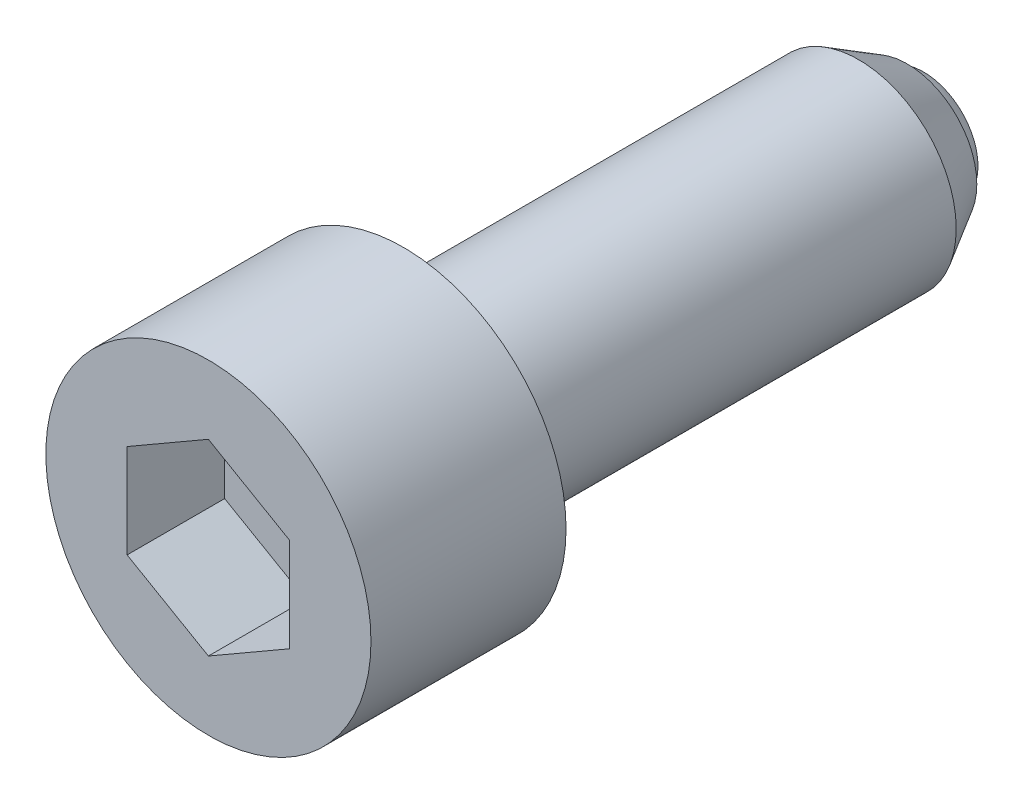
ISO-10303-21;
HEADER;
FILE_DESCRIPTION(('STEP AP214'),'2;1');
FILE_NAME('part.step','',(''),(''),'','','');
FILE_SCHEMA(('AUTOMOTIVE_DESIGN { 1 0 10303 214 1 1 1 1 }'));
ENDSEC;
DATA;
#1=APPLICATION_CONTEXT('core data for automotive mechanical design processes');
#2=APPLICATION_PROTOCOL_DEFINITION('international standard','automotive_design',2000,#1);
#3=PRODUCT_CONTEXT('',#1,'mechanical');
#4=PRODUCT('Part','Part','',(#3));
#5=PRODUCT_RELATED_PRODUCT_CATEGORY('part','',(#4));
#6=PRODUCT_DEFINITION_FORMATION('','',#4);
#7=PRODUCT_DEFINITION_CONTEXT('part definition',#1,'design');
#8=PRODUCT_DEFINITION('design','',#6,#7);
#9=PRODUCT_DEFINITION_SHAPE('','',#8);
#10=(LENGTH_UNIT() NAMED_UNIT(*) SI_UNIT(.MILLI.,.METRE.));
#11=(NAMED_UNIT(*) PLANE_ANGLE_UNIT() SI_UNIT($,.RADIAN.));
#12=(NAMED_UNIT(*) SI_UNIT($,.STERADIAN.) SOLID_ANGLE_UNIT());
#13=UNCERTAINTY_MEASURE_WITH_UNIT(LENGTH_MEASURE(1.E-05),#10,'distance_accuracy_value','');
#14=(GEOMETRIC_REPRESENTATION_CONTEXT(3) GLOBAL_UNCERTAINTY_ASSIGNED_CONTEXT((#13)) GLOBAL_UNIT_ASSIGNED_CONTEXT((#10,
#11,#12)) REPRESENTATION_CONTEXT('',''));
#15=CARTESIAN_POINT('',(0.,0.,0.));
#16=DIRECTION('',(0.,0.,1.));
#17=DIRECTION('',(1.,0.,0.));
#18=AXIS2_PLACEMENT_3D('',#15,#16,#17);
#19=CARTESIAN_POINT('',(0.,0.,1.1));
#20=DIRECTION('',(0.,0.,-1.));
#21=DIRECTION('',(1.,0.,0.));
#22=AXIS2_PLACEMENT_3D('',#19,#20,#21);
#23=SPHERICAL_SURFACE('',#22,2.);
#24=CARTESIAN_POINT('',(0.,0.,0.5));
#25=DIRECTION('',(0.,0.,-1.));
#26=DIRECTION('',(1.,0.,0.));
#27=AXIS2_PLACEMENT_3D('',#24,#25,#26);
#28=CIRCLE('',#27,1.90787840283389);
#29=CARTESIAN_POINT('',(1.90787840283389,0.,0.5));
#30=VERTEX_POINT('',#29);
#31=EDGE_CURVE('E9',#30,#30,#28,.T.);
#32=CARTESIAN_POINT('',(0.,0.,0.));
#33=DIRECTION('',(0.,0.,-1.));
#34=DIRECTION('',(1.,0.,0.));
#35=AXIS2_PLACEMENT_3D('',#32,#33,#34);
#36=CIRCLE('',#35,1.670329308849);
#37=CARTESIAN_POINT('',(1.67032930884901,0.,0.));
#38=VERTEX_POINT('',#37);
#39=EDGE_CURVE('E17',#38,#38,#36,.F.);
#40=CARTESIAN_POINT('',(1.90787840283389,0.,0.5));
#41=CARTESIAN_POINT('',(1.90614295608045,0.,0.494481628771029));
#42=CARTESIAN_POINT('',(1.90438356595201,0.,0.488970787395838));
#43=CARTESIAN_POINT('',(1.90081703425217,0.,0.477964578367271));
#44=CARTESIAN_POINT('',(1.89900989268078,0.,0.472469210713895));
#45=CARTESIAN_POINT('',(1.8953479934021,0.,0.46149436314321));
#46=CARTESIAN_POINT('',(1.89349323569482,0.,0.456014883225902));
#47=CARTESIAN_POINT('',(1.88973624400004,0.,0.445072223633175));
#48=CARTESIAN_POINT('',(1.88783401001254,0.,0.439609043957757));
#49=CARTESIAN_POINT('',(1.8839822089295,0.,0.428699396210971));
#50=CARTESIAN_POINT('',(1.88203264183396,0.,0.423252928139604));
#51=CARTESIAN_POINT('',(1.87808632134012,0.,0.412377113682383));
#52=CARTESIAN_POINT('',(1.87608956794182,0.,0.40694776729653));
#53=CARTESIAN_POINT('',(1.87204902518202,0.,0.396106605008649));
#54=CARTESIAN_POINT('',(1.87000523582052,0.,0.39069478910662));
#55=CARTESIAN_POINT('',(1.86587077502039,0.,0.379889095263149));
#56=CARTESIAN_POINT('',(1.86378010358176,0.,0.374495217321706));
#57=CARTESIAN_POINT('',(1.85955203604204,0.,0.363725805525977));
#58=CARTESIAN_POINT('',(1.85741463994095,0.,0.358350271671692));
#59=CARTESIAN_POINT('',(1.85309328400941,0.,0.347617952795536));
#60=CARTESIAN_POINT('',(1.85090932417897,0.,0.342261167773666));
#61=CARTESIAN_POINT('',(1.84649500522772,0.,0.331566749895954));
#62=CARTESIAN_POINT('',(1.84426464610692,0.,0.326229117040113));
#63=CARTESIAN_POINT('',(1.83975769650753,0.,0.315573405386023));
#64=CARTESIAN_POINT('',(1.83748110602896,0.,0.310255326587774));
#65=CARTESIAN_POINT('',(1.83288186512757,0.,0.299639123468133));
#66=CARTESIAN_POINT('',(1.83055921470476,0.,0.29434099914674));
#67=CARTESIAN_POINT('',(1.82586802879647,0.,0.283765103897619));
#68=CARTESIAN_POINT('',(1.823499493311,0.,0.278487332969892));
#69=CARTESIAN_POINT('',(1.81871671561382,0.,0.267952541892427));
#70=CARTESIAN_POINT('',(1.81630247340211,0.,0.26269552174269));
#71=CARTESIAN_POINT('',(1.81142846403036,0.,0.252202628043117));
#72=CARTESIAN_POINT('',(1.80896869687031,0.,0.246966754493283));
#73=CARTESIAN_POINT('',(1.80400382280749,0.,0.236516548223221));
#74=CARTESIAN_POINT('',(1.80149871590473,0.,0.231302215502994));
#75=CARTESIAN_POINT('',(1.79644335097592,0.,0.220895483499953));
#76=CARTESIAN_POINT('',(1.79389309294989,0.,0.215703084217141));
#77=CARTESIAN_POINT('',(1.78874761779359,0.,0.205340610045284));
#78=CARTESIAN_POINT('',(1.78615240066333,0.,0.200170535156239));
#79=CARTESIAN_POINT('',(1.78091720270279,0.,0.189853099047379));
#80=CARTESIAN_POINT('',(1.77827722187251,0.,0.184705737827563));
#81=CARTESIAN_POINT('',(1.77295269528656,0.,0.174434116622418));
#82=CARTESIAN_POINT('',(1.77026814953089,0.,0.169309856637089));
#83=CARTESIAN_POINT('',(1.76485469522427,0.,0.159084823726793));
#84=CARTESIAN_POINT('',(1.76212578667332,0.,0.153984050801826));
#85=CARTESIAN_POINT('',(1.7566238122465,0.,0.143806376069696));
#86=CARTESIAN_POINT('',(1.75385074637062,0.,0.138729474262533));
#87=CARTESIAN_POINT('',(1.7482606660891,0.,0.128599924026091));
#88=CARTESIAN_POINT('',(1.74544365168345,0.,0.123547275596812));
#89=CARTESIAN_POINT('',(1.73976588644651,0.,0.113466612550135));
#90=CARTESIAN_POINT('',(1.73690513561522,0.,0.108438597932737));
#91=CARTESIAN_POINT('',(1.73114011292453,0.,0.0984075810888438));
#92=CARTESIAN_POINT('',(1.72823584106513,0.,0.0934045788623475));
#93=CARTESIAN_POINT('',(1.72238399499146,0.,0.0834239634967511));
#94=CARTESIAN_POINT('',(1.71943642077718,0.,0.078446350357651));
#95=CARTESIAN_POINT('',(1.71349819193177,0.,0.0685168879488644));
#96=CARTESIAN_POINT('',(1.71050753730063,0.,0.0635650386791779));
#97=CARTESIAN_POINT('',(1.70448337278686,0.,0.0536874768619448));
#98=CARTESIAN_POINT('',(1.70144986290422,0.,0.0487617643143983));
#99=CARTESIAN_POINT('',(1.6953402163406,0.,0.0389368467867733));
#100=CARTESIAN_POINT('',(1.69226407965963,0.,0.034037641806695));
#101=CARTESIAN_POINT('',(1.68606941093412,0.,0.0242661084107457));
#102=CARTESIAN_POINT('',(1.68295087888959,0.,0.0193937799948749));
#103=CARTESIAN_POINT('',(1.67667165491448,0.,0.00967636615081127));
#104=CARTESIAN_POINT('',(1.67351096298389,0.,0.00483128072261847));
#105=CARTESIAN_POINT('',(1.67032930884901,0.,0.));
#106=B_SPLINE_CURVE_WITH_KNOTS('',3,(#40,#41,#42,#43,#44,#45,#46,#47,#48,#49,#50,#51,#52,#53,
#54,#55,#56,#57,#58,#59,#60,#61,#62,#63,#64,#65,#66,#67,#68,#69,#70,#71,#72,#73,#74,#75,#76,#77,
#78,#79,#80,#81,#82,#83,#84,#85,#86,#87,#88,#89,#90,#91,#92,#93,#94,#95,#96,#97,#98,#99,#100,
#101,#102,#103,#104,#105),.UNSPECIFIED.,.F.,.F.,(4,2,2,2,2,2,2,2,2,2,2,2,2,2,2,2,2,2,2,2,2,2,2,
2,2,2,2,2,2,2,2,2,4),(0.,0.0173544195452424,0.0347088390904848,0.0520632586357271,
0.0694176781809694,0.0867720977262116,0.104126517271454,0.121480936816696,0.138835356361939,
0.156189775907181,0.173544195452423,0.190898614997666,0.208253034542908,0.22560745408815,
0.242961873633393,0.260316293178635,0.277670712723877,0.295025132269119,0.312379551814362,
0.329733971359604,0.347088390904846,0.364442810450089,0.381797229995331,0.399151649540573,
0.416506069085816,0.433860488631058,0.4512149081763,0.468569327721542,0.485923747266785,
0.503278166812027,0.52063258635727,0.537987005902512,0.555341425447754),.UNSPECIFIED.);
#107=EDGE_CURVE('BSEAM14',#30,#38,#106,.T.);
#108=ORIENTED_EDGE('',*,*,#31,.T.);
#109=ORIENTED_EDGE('',*,*,#39,.T.);
#110=ORIENTED_EDGE('',*,*,#107,.T.);
#111=ORIENTED_EDGE('',*,*,#107,.F.);
#112=EDGE_LOOP('',(#108,#110,#109,#111));
#113=FACE_BOUND('',#112,.T.);
#114=ADVANCED_FACE('F14',(#113),#23,.T.);
#115=CARTESIAN_POINT('',(2.13397459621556,0.,0.5));
#116=DIRECTION('',(0.,0.,1.));
#117=DIRECTION('',(-1.,0.,0.));
#118=AXIS2_PLACEMENT_3D('',#115,#116,#117);
#119=PLANE('',#118);
#120=ORIENTED_EDGE('',*,*,#31,.F.);
#121=EDGE_LOOP('',(#120));
#122=FACE_BOUND('',#121,.T.);
#123=CARTESIAN_POINT('',(0.,0.,0.5));
#124=DIRECTION('',(0.,0.,-1.));
#125=DIRECTION('',(1.,0.,0.));
#126=AXIS2_PLACEMENT_3D('',#123,#124,#125);
#127=CIRCLE('',#126,2.13397459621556);
#128=CARTESIAN_POINT('',(2.13397459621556,0.,0.5));
#129=VERTEX_POINT('',#128);
#130=EDGE_CURVE('E22',#129,#129,#127,.T.);
#131=ORIENTED_EDGE('',*,*,#130,.T.);
#132=EDGE_LOOP('',(#131));
#133=FACE_BOUND('',#132,.T.);
#134=ADVANCED_FACE('F137',(#122,#133),#119,.F.);
#135=CARTESIAN_POINT('',(0.,0.,2.));
#136=DIRECTION('',(0.,0.,1.));
#137=DIRECTION('',(-1.,0.,0.));
#138=AXIS2_PLACEMENT_3D('',#135,#136,#137);
#139=CONICAL_SURFACE('',#138,3.,0.523598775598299);
#140=ORIENTED_EDGE('',*,*,#130,.F.);
#141=EDGE_LOOP('',(#140));
#142=FACE_BOUND('',#141,.T.);
#143=CARTESIAN_POINT('',(0.,0.,2.));
#144=DIRECTION('',(0.,0.,-1.));
#145=DIRECTION('',(1.,0.,0.));
#146=AXIS2_PLACEMENT_3D('',#143,#144,#145);
#147=CIRCLE('',#146,3.);
#148=CARTESIAN_POINT('',(3.,0.,2.));
#149=VERTEX_POINT('',#148);
#150=EDGE_CURVE('E131',#149,#149,#147,.T.);
#151=ORIENTED_EDGE('',*,*,#150,.T.);
#152=EDGE_LOOP('',(#151));
#153=FACE_BOUND('',#152,.T.);
#154=ADVANCED_FACE('F139',(#142,#153),#139,.T.);
#155=CARTESIAN_POINT('',(0.,0.,-4.));
#156=DIRECTION('',(0.,0.,-1.));
#157=DIRECTION('',(1.,0.,0.));
#158=AXIS2_PLACEMENT_3D('',#155,#156,#157);
#159=CYLINDRICAL_SURFACE('',#158,3.);
#160=ORIENTED_EDGE('',*,*,#150,.F.);
#161=EDGE_LOOP('',(#160));
#162=FACE_BOUND('',#161,.T.);
#163=CARTESIAN_POINT('',(0.,0.,16.));
#164=DIRECTION('',(0.,0.,-1.));
#165=DIRECTION('',(1.,0.,0.));
#166=AXIS2_PLACEMENT_3D('',#163,#164,#165);
#167=CIRCLE('',#166,3.);
#168=CARTESIAN_POINT('',(3.,0.,16.));
#169=VERTEX_POINT('',#168);
#170=EDGE_CURVE('E128',#169,#169,#167,.T.);
#171=ORIENTED_EDGE('',*,*,#170,.T.);
#172=EDGE_LOOP('',(#171));
#173=FACE_BOUND('',#172,.T.);
#174=ADVANCED_FACE('F142',(#162,#173),#159,.T.);
#175=CARTESIAN_POINT('',(3.,0.,16.));
#176=DIRECTION('',(0.,0.,-1.));
#177=DIRECTION('',(1.,0.,0.));
#178=AXIS2_PLACEMENT_3D('',#175,#176,#177);
#179=PLANE('',#178);
#180=CARTESIAN_POINT('',(0.,0.,16.));
#181=DIRECTION('',(0.,0.,-1.));
#182=DIRECTION('',(1.,0.,0.));
#183=AXIS2_PLACEMENT_3D('',#180,#181,#182);
#184=CIRCLE('',#183,5.);
#185=CARTESIAN_POINT('',(5.,0.,16.));
#186=VERTEX_POINT('',#185);
#187=EDGE_CURVE('E125',#186,#186,#184,.T.);
#188=ORIENTED_EDGE('',*,*,#187,.T.);
#189=EDGE_LOOP('',(#188));
#190=FACE_BOUND('',#189,.T.);
#191=ORIENTED_EDGE('',*,*,#170,.F.);
#192=EDGE_LOOP('',(#191));
#193=FACE_BOUND('',#192,.T.);
#194=ADVANCED_FACE('F148',(#190,#193),#179,.T.);
#195=CARTESIAN_POINT('',(0.,0.,-4.));
#196=DIRECTION('',(0.,0.,-1.));
#197=DIRECTION('',(1.,0.,0.));
#198=AXIS2_PLACEMENT_3D('',#195,#196,#197);
#199=CYLINDRICAL_SURFACE('',#198,5.);
#200=CARTESIAN_POINT('',(0.,0.,22.));
#201=DIRECTION('',(0.,0.,-1.));
#202=DIRECTION('',(1.,0.,0.));
#203=AXIS2_PLACEMENT_3D('',#200,#201,#202);
#204=CIRCLE('',#203,5.);
#205=CARTESIAN_POINT('',(5.,0.,22.));
#206=VERTEX_POINT('',#205);
#207=EDGE_CURVE('E122',#206,#206,#204,.T.);
#208=ORIENTED_EDGE('',*,*,#207,.T.);
#209=EDGE_LOOP('',(#208));
#210=FACE_BOUND('',#209,.T.);
#211=ORIENTED_EDGE('',*,*,#187,.F.);
#212=EDGE_LOOP('',(#211));
#213=FACE_BOUND('',#212,.T.);
#214=ADVANCED_FACE('F153',(#210,#213),#199,.T.);
#215=CARTESIAN_POINT('',(5.,0.,22.));
#216=DIRECTION('',(0.,0.,1.));
#217=DIRECTION('',(-1.,0.,0.));
#218=AXIS2_PLACEMENT_3D('',#215,#216,#217);
#219=PLANE('',#218);
#220=DIRECTION('',(-0.86602540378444,0.5,0.));
#221=VECTOR('',#220,1.);
#222=CARTESIAN_POINT('',(2.5,1.44337567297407,22.));
#223=LINE('',#222,#221);
#224=CARTESIAN_POINT('',(2.5,1.44337567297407,22.));
#225=VERTEX_POINT('',#224);
#226=CARTESIAN_POINT('',(0.,2.88675134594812,22.));
#227=VERTEX_POINT('',#226);
#228=EDGE_CURVE('E29',#225,#227,#223,.T.);
#229=ORIENTED_EDGE('',*,*,#228,.F.);
#230=DIRECTION('',(0.,1.,0.));
#231=VECTOR('',#230,1.);
#232=CARTESIAN_POINT('',(2.5,-1.44337567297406,22.));
#233=LINE('',#232,#231);
#234=CARTESIAN_POINT('',(2.5,-1.44337567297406,22.));
#235=VERTEX_POINT('',#234);
#236=EDGE_CURVE('E98',#235,#225,#233,.T.);
#237=ORIENTED_EDGE('',*,*,#236,.F.);
#238=DIRECTION('',(-0.866025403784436,-0.5,0.));
#239=VECTOR('',#238,1.);
#240=CARTESIAN_POINT('',(2.5,-1.44337567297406,22.));
#241=LINE('',#240,#239);
#242=CARTESIAN_POINT('',(0.,-2.88675134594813,22.));
#243=VERTEX_POINT('',#242);
#244=EDGE_CURVE('E93',#235,#243,#241,.T.);
#245=ORIENTED_EDGE('',*,*,#244,.T.);
#246=DIRECTION('',(0.866025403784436,-0.5,0.));
#247=VECTOR('',#246,1.);
#248=CARTESIAN_POINT('',(-2.5,-1.44337567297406,22.));
#249=LINE('',#248,#247);
#250=CARTESIAN_POINT('',(-2.5,-1.44337567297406,22.));
#251=VERTEX_POINT('',#250);
#252=EDGE_CURVE('E91',#251,#243,#249,.T.);
#253=ORIENTED_EDGE('',*,*,#252,.F.);
#254=DIRECTION('',(0.,1.,0.));
#255=VECTOR('',#254,1.);
#256=CARTESIAN_POINT('',(-2.5,-1.44337567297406,22.));
#257=LINE('',#256,#255);
#258=CARTESIAN_POINT('',(-2.5,1.44337567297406,22.));
#259=VERTEX_POINT('',#258);
#260=EDGE_CURVE('E72',#251,#259,#257,.T.);
#261=ORIENTED_EDGE('',*,*,#260,.T.);
#262=DIRECTION('',(0.866025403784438,0.5,0.));
#263=VECTOR('',#262,1.);
#264=CARTESIAN_POINT('',(-2.5,1.44337567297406,22.));
#265=LINE('',#264,#263);
#266=EDGE_CURVE('E83',#259,#227,#265,.T.);
#267=ORIENTED_EDGE('',*,*,#266,.T.);
#268=EDGE_LOOP('',(#229,#237,#245,#253,#261,#267));
#269=FACE_BOUND('',#268,.T.);
#270=ORIENTED_EDGE('',*,*,#207,.F.);
#271=EDGE_LOOP('',(#270));
#272=FACE_BOUND('',#271,.T.);
#273=ADVANCED_FACE('F87',(#269,#272),#219,.T.);
#274=CARTESIAN_POINT('',(2.5,1.44337567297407,19.));
#275=DIRECTION('',(0.5,0.86602540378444,0.));
#276=DIRECTION('',(0.86602540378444,-0.5,0.));
#277=AXIS2_PLACEMENT_3D('',#274,#275,#276);
#278=PLANE('',#277);
#279=DIRECTION('',(0.,0.,1.));
#280=VECTOR('',#279,1.);
#281=CARTESIAN_POINT('',(2.5,1.44337567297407,19.));
#282=LINE('',#281,#280);
#283=CARTESIAN_POINT('',(2.5,1.44337567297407,19.));
#284=VERTEX_POINT('',#283);
#285=EDGE_CURVE('E36',#284,#225,#282,.T.);
#286=ORIENTED_EDGE('',*,*,#285,.T.);
#287=ORIENTED_EDGE('',*,*,#228,.T.);
#288=DIRECTION('',(0.,0.,1.));
#289=VECTOR('',#288,1.);
#290=CARTESIAN_POINT('',(0.,2.88675134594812,19.));
#291=LINE('',#290,#289);
#292=CARTESIAN_POINT('',(0.,2.88675134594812,19.));
#293=VERTEX_POINT('',#292);
#294=EDGE_CURVE('E80',#293,#227,#291,.T.);
#295=ORIENTED_EDGE('',*,*,#294,.F.);
#296=DIRECTION('',(-0.86602540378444,0.5,0.));
#297=VECTOR('',#296,1.);
#298=CARTESIAN_POINT('',(2.5,1.44337567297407,19.));
#299=LINE('',#298,#297);
#300=EDGE_CURVE('E100',#284,#293,#299,.T.);
#301=ORIENTED_EDGE('',*,*,#300,.F.);
#302=EDGE_LOOP('',(#286,#287,#295,#301));
#303=FACE_BOUND('',#302,.T.);
#304=ADVANCED_FACE('F190',(#303),#278,.F.);
#305=CARTESIAN_POINT('',(2.5,-1.44337567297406,19.));
#306=DIRECTION('',(1.,0.,0.));
#307=DIRECTION('',(0.,0.,1.));
#308=AXIS2_PLACEMENT_3D('',#305,#306,#307);
#309=PLANE('',#308);
#310=DIRECTION('',(0.,0.,1.));
#311=VECTOR('',#310,1.);
#312=CARTESIAN_POINT('',(2.5,-1.44337567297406,19.));
#313=LINE('',#312,#311);
#314=CARTESIAN_POINT('',(2.5,-1.44337567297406,19.));
#315=VERTEX_POINT('',#314);
#316=EDGE_CURVE('E119',#315,#235,#313,.T.);
#317=ORIENTED_EDGE('',*,*,#316,.T.);
#318=ORIENTED_EDGE('',*,*,#236,.T.);
#319=ORIENTED_EDGE('',*,*,#285,.F.);
#320=DIRECTION('',(0.,1.,0.));
#321=VECTOR('',#320,1.);
#322=CARTESIAN_POINT('',(2.5,-1.44337567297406,19.));
#323=LINE('',#322,#321);
#324=EDGE_CURVE('E112',#315,#284,#323,.T.);
#325=ORIENTED_EDGE('',*,*,#324,.F.);
#326=EDGE_LOOP('',(#317,#318,#319,#325));
#327=FACE_BOUND('',#326,.T.);
#328=ADVANCED_FACE('F198',(#327),#309,.F.);
#329=CARTESIAN_POINT('',(2.5,-1.44337567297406,19.));
#330=DIRECTION('',(-0.5,0.866025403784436,0.));
#331=DIRECTION('',(0.866025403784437,0.5,0.));
#332=AXIS2_PLACEMENT_3D('',#329,#330,#331);
#333=PLANE('',#332);
#334=DIRECTION('',(0.,0.,1.));
#335=VECTOR('',#334,1.);
#336=CARTESIAN_POINT('',(0.,-2.88675134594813,19.));
#337=LINE('',#336,#335);
#338=CARTESIAN_POINT('',(0.,-2.88675134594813,19.));
#339=VERTEX_POINT('',#338);
#340=EDGE_CURVE('E117',#339,#243,#337,.T.);
#341=ORIENTED_EDGE('',*,*,#340,.T.);
#342=ORIENTED_EDGE('',*,*,#244,.F.);
#343=ORIENTED_EDGE('',*,*,#316,.F.);
#344=DIRECTION('',(-0.866025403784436,-0.5,0.));
#345=VECTOR('',#344,1.);
#346=CARTESIAN_POINT('',(2.5,-1.44337567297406,19.));
#347=LINE('',#346,#345);
#348=EDGE_CURVE('E109',#315,#339,#347,.T.);
#349=ORIENTED_EDGE('',*,*,#348,.T.);
#350=EDGE_LOOP('',(#341,#342,#343,#349));
#351=FACE_BOUND('',#350,.T.);
#352=ADVANCED_FACE('F194',(#351),#333,.T.);
#353=CARTESIAN_POINT('',(-2.5,-1.44337567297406,19.));
#354=DIRECTION('',(-0.5,-0.866025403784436,0.));
#355=DIRECTION('',(-0.866025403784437,0.5,0.));
#356=AXIS2_PLACEMENT_3D('',#353,#354,#355);
#357=PLANE('',#356);
#358=DIRECTION('',(0.,0.,1.));
#359=VECTOR('',#358,1.);
#360=CARTESIAN_POINT('',(-2.5,-1.44337567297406,19.));
#361=LINE('',#360,#359);
#362=CARTESIAN_POINT('',(-2.5,-1.44337567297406,19.));
#363=VERTEX_POINT('',#362);
#364=EDGE_CURVE('E79',#363,#251,#361,.T.);
#365=ORIENTED_EDGE('',*,*,#364,.T.);
#366=ORIENTED_EDGE('',*,*,#252,.T.);
#367=ORIENTED_EDGE('',*,*,#340,.F.);
#368=DIRECTION('',(0.866025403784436,-0.5,0.));
#369=VECTOR('',#368,1.);
#370=CARTESIAN_POINT('',(-2.5,-1.44337567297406,19.));
#371=LINE('',#370,#369);
#372=EDGE_CURVE('E106',#363,#339,#371,.T.);
#373=ORIENTED_EDGE('',*,*,#372,.F.);
#374=EDGE_LOOP('',(#365,#366,#367,#373));
#375=FACE_BOUND('',#374,.T.);
#376=ADVANCED_FACE('F187',(#375),#357,.F.);
#377=CARTESIAN_POINT('',(-2.5,-1.44337567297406,19.));
#378=DIRECTION('',(1.,0.,0.));
#379=DIRECTION('',(0.,-1.,0.));
#380=AXIS2_PLACEMENT_3D('',#377,#378,#379);
#381=PLANE('',#380);
#382=DIRECTION('',(0.,0.,1.));
#383=VECTOR('',#382,1.);
#384=CARTESIAN_POINT('',(-2.5,1.44337567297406,19.));
#385=LINE('',#384,#383);
#386=CARTESIAN_POINT('',(-2.5,1.44337567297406,19.));
#387=VERTEX_POINT('',#386);
#388=EDGE_CURVE('E68',#387,#259,#385,.T.);
#389=ORIENTED_EDGE('',*,*,#388,.T.);
#390=ORIENTED_EDGE('',*,*,#260,.F.);
#391=ORIENTED_EDGE('',*,*,#364,.F.);
#392=DIRECTION('',(0.,1.,0.));
#393=VECTOR('',#392,1.);
#394=CARTESIAN_POINT('',(-2.5,-1.44337567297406,19.));
#395=LINE('',#394,#393);
#396=EDGE_CURVE('E75',#363,#387,#395,.T.);
#397=ORIENTED_EDGE('',*,*,#396,.T.);
#398=EDGE_LOOP('',(#389,#390,#391,#397));
#399=FACE_BOUND('',#398,.T.);
#400=ADVANCED_FACE('F70',(#399),#381,.T.);
#401=CARTESIAN_POINT('',(-2.5,1.44337567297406,19.));
#402=DIRECTION('',(0.5,-0.866025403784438,0.));
#403=DIRECTION('',(-0.866025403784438,-0.5,0.));
#404=AXIS2_PLACEMENT_3D('',#401,#402,#403);
#405=PLANE('',#404);
#406=DIRECTION('',(0.866025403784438,0.5,0.));
#407=VECTOR('',#406,1.);
#408=CARTESIAN_POINT('',(-2.5,1.44337567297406,19.));
#409=LINE('',#408,#407);
#410=EDGE_CURVE('E103',#387,#293,#409,.T.);
#411=ORIENTED_EDGE('',*,*,#410,.T.);
#412=ORIENTED_EDGE('',*,*,#294,.T.);
#413=ORIENTED_EDGE('',*,*,#266,.F.);
#414=ORIENTED_EDGE('',*,*,#388,.F.);
#415=EDGE_LOOP('',(#411,#412,#413,#414));
#416=FACE_BOUND('',#415,.T.);
#417=ADVANCED_FACE('F84',(#416),#405,.T.);
#418=CARTESIAN_POINT('',(2.5,1.44337567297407,19.));
#419=DIRECTION('',(0.,0.,-1.));
#420=DIRECTION('',(1.,0.,0.));
#421=AXIS2_PLACEMENT_3D('',#418,#419,#420);
#422=PLANE('',#421);
#423=ORIENTED_EDGE('',*,*,#300,.T.);
#424=ORIENTED_EDGE('',*,*,#410,.F.);
#425=ORIENTED_EDGE('',*,*,#396,.F.);
#426=ORIENTED_EDGE('',*,*,#372,.T.);
#427=ORIENTED_EDGE('',*,*,#348,.F.);
#428=ORIENTED_EDGE('',*,*,#324,.T.);
#429=EDGE_LOOP('',(#423,#424,#425,#426,#427,#428));
#430=FACE_BOUND('',#429,.T.);
#431=ADVANCED_FACE('F175',(#430),#422,.F.);
#432=CARTESIAN_POINT('',(0.,0.,0.));
#433=DIRECTION('',(0.,0.,-1.));
#434=DIRECTION('',(1.,0.,0.));
#435=AXIS2_PLACEMENT_3D('',#432,#433,#434);
#436=PLANE('',#435);
#437=ORIENTED_EDGE('',*,*,#39,.F.);
#438=EDGE_LOOP('',(#437));
#439=FACE_BOUND('',#438,.T.);
#440=ADVANCED_FACE('F173',(#439),#436,.T.);
#441=CLOSED_SHELL('',(#114,#134,#154,#174,#194,#214,#273,#304,#328,#352,#376,#400,#417,#431,#440));
#442=MANIFOLD_SOLID_BREP('B1',#441);
#443=ADVANCED_BREP_SHAPE_REPRESENTATION('',(#18,#442),#14);
#444=SHAPE_DEFINITION_REPRESENTATION(#9,#443);
ENDSEC;
END-ISO-10303-21;
